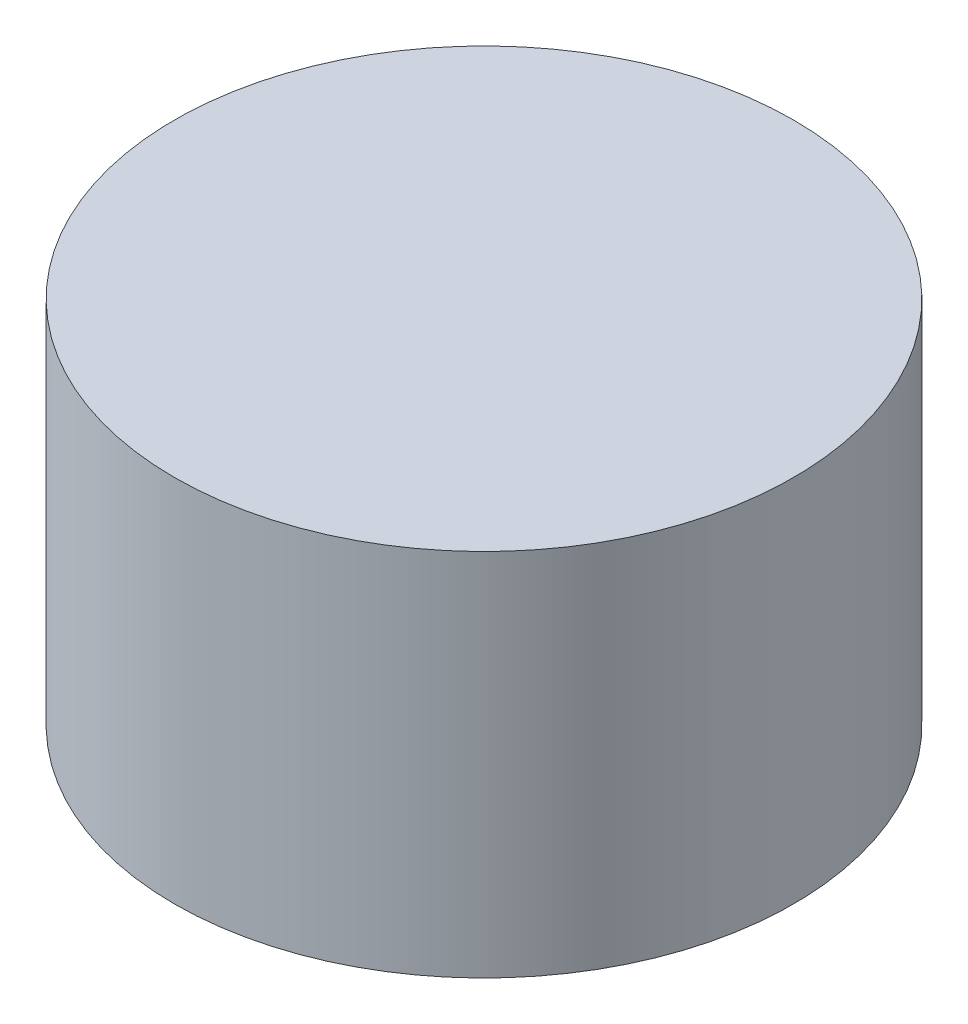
ISO-10303-21;
HEADER;
FILE_DESCRIPTION(('STEP AP214'),'2;1');
FILE_NAME('part.step','',(''),(''),'','','');
FILE_SCHEMA(('AUTOMOTIVE_DESIGN { 1 0 10303 214 1 1 1 1 }'));
ENDSEC;
DATA;
#1=APPLICATION_CONTEXT('core data for automotive mechanical design processes');
#2=APPLICATION_PROTOCOL_DEFINITION('international standard','automotive_design',2000,#1);
#3=PRODUCT_CONTEXT('',#1,'mechanical');
#4=PRODUCT('Part','Part','',(#3));
#5=PRODUCT_RELATED_PRODUCT_CATEGORY('part','',(#4));
#6=PRODUCT_DEFINITION_FORMATION('','',#4);
#7=PRODUCT_DEFINITION_CONTEXT('part definition',#1,'design');
#8=PRODUCT_DEFINITION('design','',#6,#7);
#9=PRODUCT_DEFINITION_SHAPE('','',#8);
#10=(LENGTH_UNIT() NAMED_UNIT(*) SI_UNIT(.MILLI.,.METRE.));
#11=(NAMED_UNIT(*) PLANE_ANGLE_UNIT() SI_UNIT($,.RADIAN.));
#12=(NAMED_UNIT(*) SI_UNIT($,.STERADIAN.) SOLID_ANGLE_UNIT());
#13=UNCERTAINTY_MEASURE_WITH_UNIT(LENGTH_MEASURE(1.E-05),#10,'distance_accuracy_value','');
#14=(GEOMETRIC_REPRESENTATION_CONTEXT(3) GLOBAL_UNCERTAINTY_ASSIGNED_CONTEXT((#13)) GLOBAL_UNIT_ASSIGNED_CONTEXT((#10,
#11,#12)) REPRESENTATION_CONTEXT('',''));
#15=CARTESIAN_POINT('',(0.,0.,0.));
#16=DIRECTION('',(0.,0.,1.));
#17=DIRECTION('',(1.,0.,0.));
#18=AXIS2_PLACEMENT_3D('',#15,#16,#17);
#19=CARTESIAN_POINT('',(0.,34.,0.));
#20=DIRECTION('',(0.,-1.,0.));
#21=DIRECTION('',(0.,0.,-1.));
#22=AXIS2_PLACEMENT_3D('',#19,#20,#21);
#23=CYLINDRICAL_SURFACE('',#22,28.4975077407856);
#24=CARTESIAN_POINT('',(0.,34.,0.));
#25=DIRECTION('',(0.,1.,0.));
#26=DIRECTION('',(0.,0.,1.));
#27=AXIS2_PLACEMENT_3D('',#24,#25,#26);
#28=CIRCLE('',#27,28.4975077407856);
#29=CARTESIAN_POINT('',(0.,34.,28.4975077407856));
#30=VERTEX_POINT('',#29);
#31=EDGE_CURVE('E10',#30,#30,#28,.T.);
#32=ORIENTED_EDGE('',*,*,#31,.F.);
#33=EDGE_LOOP('',(#32));
#34=FACE_BOUND('',#33,.T.);
#35=CARTESIAN_POINT('',(0.,0.,0.));
#36=DIRECTION('',(0.,1.,0.));
#37=DIRECTION('',(0.,0.,1.));
#38=AXIS2_PLACEMENT_3D('',#35,#36,#37);
#39=CIRCLE('',#38,28.4975077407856);
#40=CARTESIAN_POINT('',(0.,0.,28.4975077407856));
#41=VERTEX_POINT('',#40);
#42=EDGE_CURVE('E35',#41,#41,#39,.T.);
#43=ORIENTED_EDGE('',*,*,#42,.T.);
#44=EDGE_LOOP('',(#43));
#45=FACE_BOUND('',#44,.T.);
#46=ADVANCED_FACE('F29',(#34,#45),#23,.T.);
#47=CARTESIAN_POINT('',(0.,34.,0.));
#48=DIRECTION('',(0.,1.,0.));
#49=DIRECTION('',(0.,0.,1.));
#50=AXIS2_PLACEMENT_3D('',#47,#48,#49);
#51=PLANE('',#50);
#52=ORIENTED_EDGE('',*,*,#31,.T.);
#53=EDGE_LOOP('',(#52));
#54=FACE_BOUND('',#53,.T.);
#55=ADVANCED_FACE('F44',(#54),#51,.T.);
#56=CARTESIAN_POINT('',(0.,0.,0.));
#57=DIRECTION('',(0.,1.,0.));
#58=DIRECTION('',(0.,0.,1.));
#59=AXIS2_PLACEMENT_3D('',#56,#57,#58);
#60=PLANE('',#59);
#61=ORIENTED_EDGE('',*,*,#42,.F.);
#62=EDGE_LOOP('',(#61));
#63=FACE_BOUND('',#62,.T.);
#64=ADVANCED_FACE('F42',(#63),#60,.F.);
#65=CLOSED_SHELL('',(#46,#55,#64));
#66=MANIFOLD_SOLID_BREP('B2',#65);
#67=ADVANCED_BREP_SHAPE_REPRESENTATION('',(#18,#66),#14);
#68=SHAPE_DEFINITION_REPRESENTATION(#9,#67);
ENDSEC;
END-ISO-10303-21;
